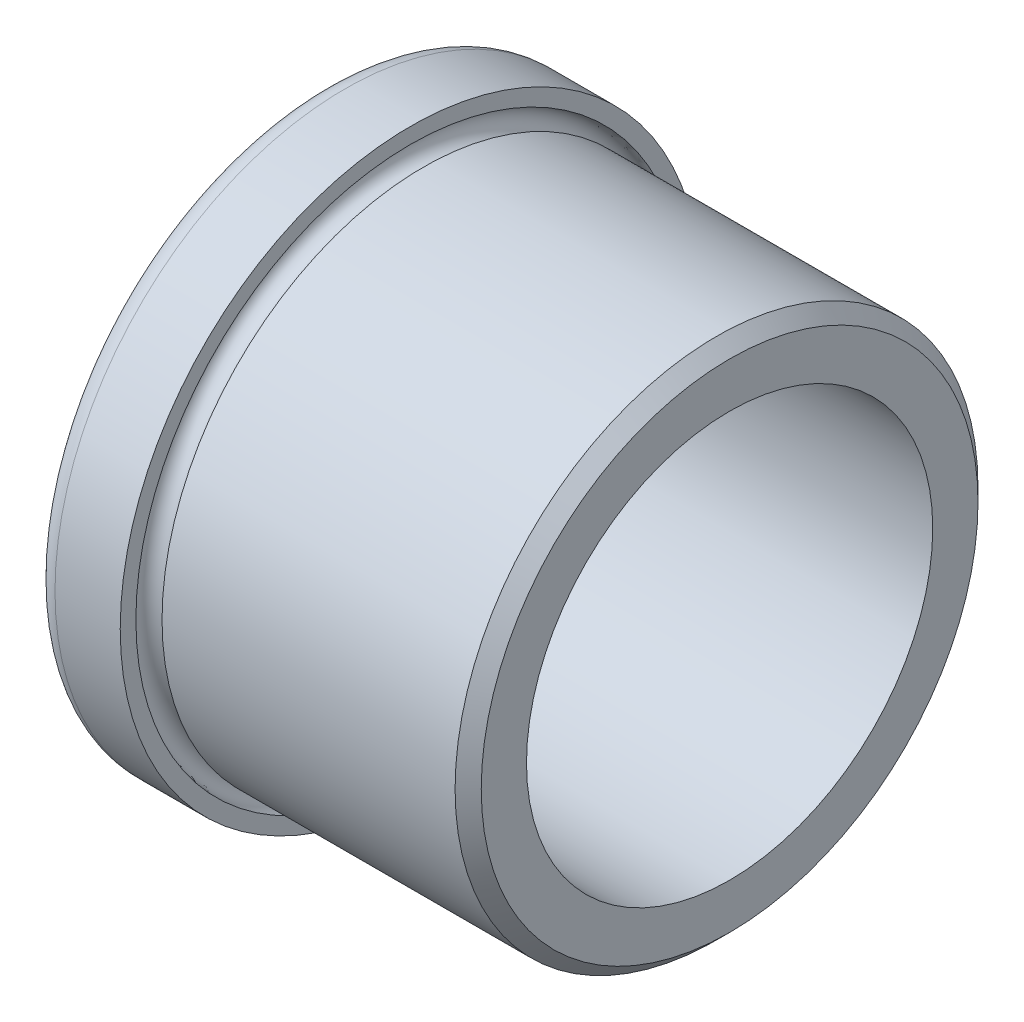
from build123d import *


with BuildPart() as part:
    # Sketch1 → BaseBody (revolve)
    with BuildSketch(Plane.XY, mode=Mode.PRIVATE) as basebody_sk:
        with BuildLine():
            Line((0, 24.6126), (0, 29.3624))
            ThreePointArc((0, 29.3624), (0.699311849, 31.050688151), (2.3876, 31.75))
            Line((2.3876, 31.75), (9.525, 31.75))
            Line((9.525, 31.75), (9.525, 30.0370875))
            ThreePointArc((9.525, 30.0370875), (8.513598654, 27.595348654), (10.9553375, 28.60675))
            Line((10.9553375, 28.60675), (43.0196625, 28.60675))
            Line((43.0196625, 28.60675), (44.45, 27.1764125))
            Line((44.45, 27.1764125), (44.45, 22.225))
            Line((44.45, 22.225), (2.3876, 22.225))
            ThreePointArc((2.3876, 22.225), (0.699311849, 22.924311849), (0, 24.6126))
        make_face()
    revolve(basebody_sk.sketch.rotate(Axis((0, 0, 0), (1, 0, 0)), 90), axis=Axis((0, 0, 0), (1, 0, 0)))


solid = part.part
